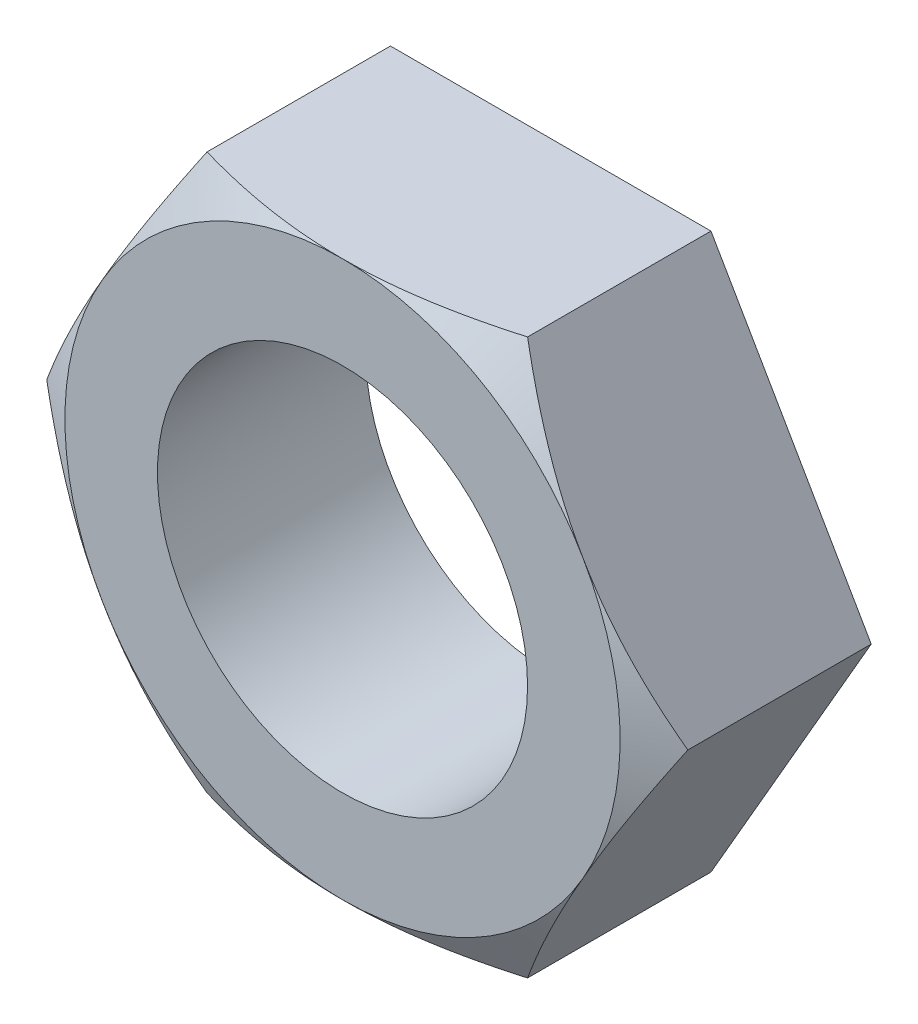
from build123d import *

# Parameters (mm, degrees)
SKETCH1_R          = 9.525
BASE_EXTRUDE_DEPTH = 10.715625


with BuildPart() as part:
    # Sketch1 → Base-Extrude (new body)
    with BuildSketch(Plane.XY):
        Polygon((-8.248891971, 14.2875), (8.248891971, 14.2875), (16.497783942, 0), (8.248891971, -14.2875), (-8.248891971, -14.2875), (-16.497783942, 0), align=None)
        Circle(SKETCH1_R, mode=Mode.SUBTRACT)
    extrude(amount=BASE_EXTRUDE_DEPTH)

    # Sketch3 → Cut-Revolve2 (revolve, cut)
    with BuildSketch(Plane(origin=(0, 0, 0), x_dir=(1, 0, 0), z_dir=(0, 1, 0))):
        Polygon((-14.2875, -10.715625), (-16.497783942, -10.715625), (-16.497783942, -9.439516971), align=None)
    revolve(axis=Axis((0, 0, 5.08), (0, 0, -1)), mode=Mode.SUBTRACT)


solid = part.part
